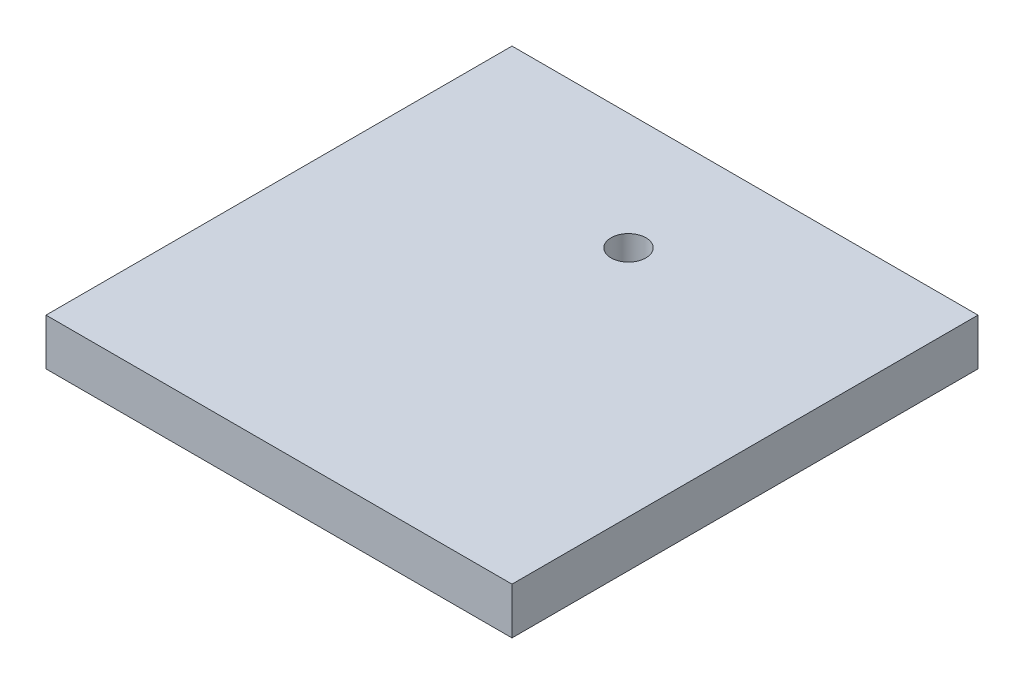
ISO-10303-21;
HEADER;
FILE_DESCRIPTION(('STEP AP214'),'2;1');
FILE_NAME('part.step','',(''),(''),'','','');
FILE_SCHEMA(('AUTOMOTIVE_DESIGN { 1 0 10303 214 1 1 1 1 }'));
ENDSEC;
DATA;
#1=APPLICATION_CONTEXT('core data for automotive mechanical design processes');
#2=APPLICATION_PROTOCOL_DEFINITION('international standard','automotive_design',2000,#1);
#3=PRODUCT_CONTEXT('',#1,'mechanical');
#4=PRODUCT('Part','Part','',(#3));
#5=PRODUCT_RELATED_PRODUCT_CATEGORY('part','',(#4));
#6=PRODUCT_DEFINITION_FORMATION('','',#4);
#7=PRODUCT_DEFINITION_CONTEXT('part definition',#1,'design');
#8=PRODUCT_DEFINITION('design','',#6,#7);
#9=PRODUCT_DEFINITION_SHAPE('','',#8);
#10=(LENGTH_UNIT() NAMED_UNIT(*) SI_UNIT(.MILLI.,.METRE.));
#11=(NAMED_UNIT(*) PLANE_ANGLE_UNIT() SI_UNIT($,.RADIAN.));
#12=(NAMED_UNIT(*) SI_UNIT($,.STERADIAN.) SOLID_ANGLE_UNIT());
#13=UNCERTAINTY_MEASURE_WITH_UNIT(LENGTH_MEASURE(1.E-05),#10,'distance_accuracy_value','');
#14=(GEOMETRIC_REPRESENTATION_CONTEXT(3) GLOBAL_UNCERTAINTY_ASSIGNED_CONTEXT((#13)) GLOBAL_UNIT_ASSIGNED_CONTEXT((#10,
#11,#12)) REPRESENTATION_CONTEXT('',''));
#15=CARTESIAN_POINT('',(0.,0.,0.));
#16=DIRECTION('',(0.,0.,1.));
#17=DIRECTION('',(1.,0.,0.));
#18=AXIS2_PLACEMENT_3D('',#15,#16,#17);
#19=CARTESIAN_POINT('',(0.,10.,0.));
#20=DIRECTION('',(1.,0.,0.));
#21=DIRECTION('',(0.,0.,-1.));
#22=AXIS2_PLACEMENT_3D('',#19,#20,#21);
#23=PLANE('',#22);
#24=DIRECTION('',(0.,0.,1.));
#25=VECTOR('',#24,1.);
#26=CARTESIAN_POINT('',(0.,0.,0.));
#27=LINE('',#26,#25);
#28=CARTESIAN_POINT('',(0.,0.,-100.));
#29=VERTEX_POINT('',#28);
#30=CARTESIAN_POINT('',(0.,0.,0.));
#31=VERTEX_POINT('',#30);
#32=EDGE_CURVE('E97',#29,#31,#27,.T.);
#33=ORIENTED_EDGE('',*,*,#32,.T.);
#34=DIRECTION('',(0.,-1.,0.));
#35=VECTOR('',#34,1.);
#36=CARTESIAN_POINT('',(0.,10.,0.));
#37=LINE('',#36,#35);
#38=CARTESIAN_POINT('',(0.,10.,0.));
#39=VERTEX_POINT('',#38);
#40=EDGE_CURVE('E11',#39,#31,#37,.T.);
#41=ORIENTED_EDGE('',*,*,#40,.F.);
#42=DIRECTION('',(0.,0.,1.));
#43=VECTOR('',#42,1.);
#44=CARTESIAN_POINT('',(0.,10.,0.));
#45=LINE('',#44,#43);
#46=CARTESIAN_POINT('',(0.,10.,-100.));
#47=VERTEX_POINT('',#46);
#48=EDGE_CURVE('E84',#47,#39,#45,.T.);
#49=ORIENTED_EDGE('',*,*,#48,.F.);
#50=DIRECTION('',(0.,-1.,0.));
#51=VECTOR('',#50,1.);
#52=CARTESIAN_POINT('',(0.,10.,-100.));
#53=LINE('',#52,#51);
#54=EDGE_CURVE('E93',#47,#29,#53,.T.);
#55=ORIENTED_EDGE('',*,*,#54,.T.);
#56=EDGE_LOOP('',(#33,#41,#49,#55));
#57=FACE_BOUND('',#56,.T.);
#58=ADVANCED_FACE('F32',(#57),#23,.F.);
#59=CARTESIAN_POINT('',(0.,10.,0.));
#60=DIRECTION('',(0.,0.,-1.));
#61=DIRECTION('',(-1.,0.,0.));
#62=AXIS2_PLACEMENT_3D('',#59,#60,#61);
#63=PLANE('',#62);
#64=DIRECTION('',(1.,0.,0.));
#65=VECTOR('',#64,1.);
#66=CARTESIAN_POINT('',(0.,0.,0.));
#67=LINE('',#66,#65);
#68=CARTESIAN_POINT('',(100.,0.,0.));
#69=VERTEX_POINT('',#68);
#70=EDGE_CURVE('E88',#31,#69,#67,.T.);
#71=ORIENTED_EDGE('',*,*,#70,.T.);
#72=DIRECTION('',(0.,-1.,0.));
#73=VECTOR('',#72,1.);
#74=CARTESIAN_POINT('',(100.,10.,0.));
#75=LINE('',#74,#73);
#76=CARTESIAN_POINT('',(100.,10.,0.));
#77=VERTEX_POINT('',#76);
#78=EDGE_CURVE('E41',#77,#69,#75,.T.);
#79=ORIENTED_EDGE('',*,*,#78,.F.);
#80=DIRECTION('',(1.,0.,0.));
#81=VECTOR('',#80,1.);
#82=CARTESIAN_POINT('',(0.,10.,0.));
#83=LINE('',#82,#81);
#84=EDGE_CURVE('E79',#39,#77,#83,.T.);
#85=ORIENTED_EDGE('',*,*,#84,.F.);
#86=ORIENTED_EDGE('',*,*,#40,.T.);
#87=EDGE_LOOP('',(#71,#79,#85,#86));
#88=FACE_BOUND('',#87,.T.);
#89=ADVANCED_FACE('F87',(#88),#63,.F.);
#90=CARTESIAN_POINT('',(100.,10.,0.));
#91=DIRECTION('',(-1.,0.,0.));
#92=DIRECTION('',(0.,0.,1.));
#93=AXIS2_PLACEMENT_3D('',#90,#91,#92);
#94=PLANE('',#93);
#95=DIRECTION('',(0.,0.,-1.));
#96=VECTOR('',#95,1.);
#97=CARTESIAN_POINT('',(100.,0.,0.));
#98=LINE('',#97,#96);
#99=CARTESIAN_POINT('',(100.,0.,-100.));
#100=VERTEX_POINT('',#99);
#101=EDGE_CURVE('E66',#69,#100,#98,.T.);
#102=ORIENTED_EDGE('',*,*,#101,.T.);
#103=DIRECTION('',(0.,-1.,0.));
#104=VECTOR('',#103,1.);
#105=CARTESIAN_POINT('',(100.,10.,-100.));
#106=LINE('',#105,#104);
#107=CARTESIAN_POINT('',(100.,10.,-100.));
#108=VERTEX_POINT('',#107);
#109=EDGE_CURVE('E89',#108,#100,#106,.T.);
#110=ORIENTED_EDGE('',*,*,#109,.F.);
#111=DIRECTION('',(0.,0.,-1.));
#112=VECTOR('',#111,1.);
#113=CARTESIAN_POINT('',(100.,10.,0.));
#114=LINE('',#113,#112);
#115=EDGE_CURVE('E82',#77,#108,#114,.T.);
#116=ORIENTED_EDGE('',*,*,#115,.F.);
#117=ORIENTED_EDGE('',*,*,#78,.T.);
#118=EDGE_LOOP('',(#102,#110,#116,#117));
#119=FACE_BOUND('',#118,.T.);
#120=ADVANCED_FACE('F91',(#119),#94,.F.);
#121=CARTESIAN_POINT('',(0.,10.,-100.));
#122=DIRECTION('',(0.,0.,1.));
#123=DIRECTION('',(1.,0.,0.));
#124=AXIS2_PLACEMENT_3D('',#121,#122,#123);
#125=PLANE('',#124);
#126=DIRECTION('',(-1.,0.,0.));
#127=VECTOR('',#126,1.);
#128=CARTESIAN_POINT('',(0.,0.,-100.));
#129=LINE('',#128,#127);
#130=EDGE_CURVE('E72',#100,#29,#129,.T.);
#131=ORIENTED_EDGE('',*,*,#130,.T.);
#132=ORIENTED_EDGE('',*,*,#54,.F.);
#133=DIRECTION('',(-1.,0.,0.));
#134=VECTOR('',#133,1.);
#135=CARTESIAN_POINT('',(0.,10.,-100.));
#136=LINE('',#135,#134);
#137=EDGE_CURVE('E49',#108,#47,#136,.T.);
#138=ORIENTED_EDGE('',*,*,#137,.F.);
#139=ORIENTED_EDGE('',*,*,#109,.T.);
#140=EDGE_LOOP('',(#131,#132,#138,#139));
#141=FACE_BOUND('',#140,.T.);
#142=ADVANCED_FACE('F104',(#141),#125,.F.);
#143=CARTESIAN_POINT('',(0.,10.,-100.));
#144=DIRECTION('',(0.,-1.,0.));
#145=DIRECTION('',(0.,0.,-1.));
#146=AXIS2_PLACEMENT_3D('',#143,#144,#145);
#147=PLANE('',#146);
#148=CARTESIAN_POINT('',(50.,10.,-75.));
#149=DIRECTION('',(0.,1.,0.));
#150=DIRECTION('',(0.,0.,1.));
#151=AXIS2_PLACEMENT_3D('',#148,#149,#150);
#152=CIRCLE('',#151,3.75);
#153=CARTESIAN_POINT('',(50.,10.,-71.25));
#154=VERTEX_POINT('',#153);
#155=EDGE_CURVE('E113',#154,#154,#152,.T.);
#156=ORIENTED_EDGE('',*,*,#155,.F.);
#157=EDGE_LOOP('',(#156));
#158=FACE_BOUND('',#157,.T.);
#159=ORIENTED_EDGE('',*,*,#48,.T.);
#160=ORIENTED_EDGE('',*,*,#84,.T.);
#161=ORIENTED_EDGE('',*,*,#115,.T.);
#162=ORIENTED_EDGE('',*,*,#137,.T.);
#163=EDGE_LOOP('',(#159,#160,#161,#162));
#164=FACE_BOUND('',#163,.T.);
#165=ADVANCED_FACE('F80',(#158,#164),#147,.F.);
#166=CARTESIAN_POINT('',(0.,0.,-100.));
#167=DIRECTION('',(0.,-1.,0.));
#168=DIRECTION('',(0.,0.,-1.));
#169=AXIS2_PLACEMENT_3D('',#166,#167,#168);
#170=PLANE('',#169);
#171=CARTESIAN_POINT('',(50.,0.,-75.));
#172=DIRECTION('',(0.,-1.,0.));
#173=DIRECTION('',(0.,0.,-1.));
#174=AXIS2_PLACEMENT_3D('',#171,#172,#173);
#175=CIRCLE('',#174,0.421441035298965);
#176=CARTESIAN_POINT('',(50.,0.,-74.578558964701));
#177=VERTEX_POINT('',#176);
#178=EDGE_CURVE('E35',#177,#177,#175,.T.);
#179=ORIENTED_EDGE('',*,*,#178,.F.);
#180=EDGE_LOOP('',(#179));
#181=FACE_BOUND('',#180,.T.);
#182=ORIENTED_EDGE('',*,*,#32,.F.);
#183=ORIENTED_EDGE('',*,*,#130,.F.);
#184=ORIENTED_EDGE('',*,*,#101,.F.);
#185=ORIENTED_EDGE('',*,*,#70,.F.);
#186=EDGE_LOOP('',(#182,#183,#184,#185));
#187=FACE_BOUND('',#186,.T.);
#188=ADVANCED_FACE('F107',(#181,#187),#170,.T.);
#189=CARTESIAN_POINT('',(50.,2.,-75.));
#190=DIRECTION('',(0.,1.,0.));
#191=DIRECTION('',(0.,0.,1.));
#192=AXIS2_PLACEMENT_3D('',#189,#190,#191);
#193=CONICAL_SURFACE('',#192,3.75,1.02974425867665);
#194=CARTESIAN_POINT('',(50.,2.,-75.));
#195=DIRECTION('',(0.,1.,0.));
#196=DIRECTION('',(0.,0.,1.));
#197=AXIS2_PLACEMENT_3D('',#194,#195,#196);
#198=CIRCLE('',#197,3.75);
#199=CARTESIAN_POINT('',(50.,2.,-71.25));
#200=VERTEX_POINT('',#199);
#201=EDGE_CURVE('E110',#200,#200,#198,.T.);
#202=CARTESIAN_POINT('',(50.,0.,-74.578558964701));
#203=CARTESIAN_POINT('',(50.,0.0208333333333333,-74.5438864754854));
#204=CARTESIAN_POINT('',(50.,0.0416666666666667,-74.5092139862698));
#205=CARTESIAN_POINT('',(50.,0.0833333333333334,-74.4398690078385));
#206=CARTESIAN_POINT('',(50.,0.104166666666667,-74.4051965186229));
#207=CARTESIAN_POINT('',(50.,0.145833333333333,-74.3358515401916));
#208=CARTESIAN_POINT('',(50.,0.166666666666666,-74.301179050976));
#209=CARTESIAN_POINT('',(50.,0.208333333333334,-74.2318340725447));
#210=CARTESIAN_POINT('',(50.,0.229166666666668,-74.1971615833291));
#211=CARTESIAN_POINT('',(50.,0.270833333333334,-74.1278166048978));
#212=CARTESIAN_POINT('',(50.,0.291666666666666,-74.0931441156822));
#213=CARTESIAN_POINT('',(50.,0.333333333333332,-74.0237991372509));
#214=CARTESIAN_POINT('',(50.,0.354166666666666,-73.9891266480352));
#215=CARTESIAN_POINT('',(50.,0.395833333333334,-73.919781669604));
#216=CARTESIAN_POINT('',(50.,0.416666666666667,-73.8851091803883));
#217=CARTESIAN_POINT('',(50.,0.458333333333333,-73.8157642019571));
#218=CARTESIAN_POINT('',(50.,0.479166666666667,-73.7810917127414));
#219=CARTESIAN_POINT('',(50.,0.520833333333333,-73.7117467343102));
#220=CARTESIAN_POINT('',(50.,0.541666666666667,-73.6770742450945));
#221=CARTESIAN_POINT('',(50.,0.583333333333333,-73.6077292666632));
#222=CARTESIAN_POINT('',(50.,0.604166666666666,-73.5730567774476));
#223=CARTESIAN_POINT('',(50.,0.645833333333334,-73.5037117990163));
#224=CARTESIAN_POINT('',(50.,0.666666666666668,-73.4690393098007));
#225=CARTESIAN_POINT('',(50.,0.708333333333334,-73.3996943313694));
#226=CARTESIAN_POINT('',(50.,0.729166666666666,-73.3650218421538));
#227=CARTESIAN_POINT('',(50.,0.770833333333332,-73.2956768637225));
#228=CARTESIAN_POINT('',(50.,0.791666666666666,-73.2610043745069));
#229=CARTESIAN_POINT('',(50.,0.833333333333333,-73.1916593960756));
#230=CARTESIAN_POINT('',(50.,0.854166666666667,-73.15698690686));
#231=CARTESIAN_POINT('',(50.,0.895833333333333,-73.0876419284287));
#232=CARTESIAN_POINT('',(50.,0.916666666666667,-73.0529694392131));
#233=CARTESIAN_POINT('',(50.,0.958333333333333,-72.9836244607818));
#234=CARTESIAN_POINT('',(50.,0.979166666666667,-72.9489519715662));
#235=CARTESIAN_POINT('',(50.,1.02083333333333,-72.8796069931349));
#236=CARTESIAN_POINT('',(50.,1.04166666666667,-72.8449345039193));
#237=CARTESIAN_POINT('',(50.,1.08333333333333,-72.775589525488));
#238=CARTESIAN_POINT('',(50.,1.10416666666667,-72.7409170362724));
#239=CARTESIAN_POINT('',(50.,1.14583333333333,-72.6715720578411));
#240=CARTESIAN_POINT('',(50.,1.16666666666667,-72.6368995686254));
#241=CARTESIAN_POINT('',(50.,1.20833333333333,-72.5675545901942));
#242=CARTESIAN_POINT('',(50.,1.22916666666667,-72.5328821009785));
#243=CARTESIAN_POINT('',(50.,1.27083333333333,-72.4635371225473));
#244=CARTESIAN_POINT('',(50.,1.29166666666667,-72.4288646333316));
#245=CARTESIAN_POINT('',(50.,1.33333333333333,-72.3595196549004));
#246=CARTESIAN_POINT('',(50.,1.35416666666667,-72.3248471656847));
#247=CARTESIAN_POINT('',(50.,1.39583333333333,-72.2555021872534));
#248=CARTESIAN_POINT('',(50.,1.41666666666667,-72.2208296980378));
#249=CARTESIAN_POINT('',(50.,1.45833333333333,-72.1514847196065));
#250=CARTESIAN_POINT('',(50.,1.47916666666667,-72.1168122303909));
#251=CARTESIAN_POINT('',(50.,1.52083333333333,-72.0474672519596));
#252=CARTESIAN_POINT('',(50.,1.54166666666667,-72.012794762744));
#253=CARTESIAN_POINT('',(50.,1.58333333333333,-71.9434497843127));
#254=CARTESIAN_POINT('',(50.,1.60416666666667,-71.9087772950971));
#255=CARTESIAN_POINT('',(50.,1.64583333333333,-71.8394323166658));
#256=CARTESIAN_POINT('',(50.,1.66666666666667,-71.8047598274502));
#257=CARTESIAN_POINT('',(50.,1.70833333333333,-71.7354148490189));
#258=CARTESIAN_POINT('',(50.,1.72916666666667,-71.7007423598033));
#259=CARTESIAN_POINT('',(50.,1.77083333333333,-71.631397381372));
#260=CARTESIAN_POINT('',(50.,1.79166666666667,-71.5967248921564));
#261=CARTESIAN_POINT('',(50.,1.83333333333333,-71.5273799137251));
#262=CARTESIAN_POINT('',(50.,1.85416666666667,-71.4927074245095));
#263=CARTESIAN_POINT('',(50.,1.89583333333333,-71.4233624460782));
#264=CARTESIAN_POINT('',(50.,1.91666666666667,-71.3886899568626));
#265=CARTESIAN_POINT('',(50.,1.95833333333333,-71.3193449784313));
#266=CARTESIAN_POINT('',(50.,1.97916666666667,-71.2846724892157));
#267=CARTESIAN_POINT('',(50.,2.,-71.25));
#268=B_SPLINE_CURVE_WITH_KNOTS('',3,(#202,#203,#204,#205,#206,#207,#208,#209,#210,#211,#212,
#213,#214,#215,#216,#217,#218,#219,#220,#221,#222,#223,#224,#225,#226,#227,#228,#229,#230,#231,
#232,#233,#234,#235,#236,#237,#238,#239,#240,#241,#242,#243,#244,#245,#246,#247,#248,#249,#250,
#251,#252,#253,#254,#255,#256,#257,#258,#259,#260,#261,#262,#263,#264,#265,#266,#267),
.UNSPECIFIED.,.F.,.F.,(4,2,2,2,2,2,2,2,2,2,2,2,2,2,2,2,2,2,2,2,2,2,2,2,2,2,2,2,2,2,2,2,4),(0.,
0.121350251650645,0.242700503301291,0.364050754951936,0.485401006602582,0.606751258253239,
0.728101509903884,0.84945176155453,0.970802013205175,1.09215226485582,1.21350251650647,
1.33485276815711,1.45620301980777,1.57755327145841,1.69890352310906,1.82025377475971,
1.94160402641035,2.062954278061,2.18430452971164,2.3056547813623,2.42700503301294,
2.54835528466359,2.66970553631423,2.79105578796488,2.91240603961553,3.03375629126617,
3.15510654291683,3.27645679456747,3.39780704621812,3.51915729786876,3.64050754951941,
3.76185780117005,3.8832080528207),.UNSPECIFIED.);
#269=EDGE_CURVE('BSEAM125',#177,#200,#268,.T.);
#270=ORIENTED_EDGE('',*,*,#178,.T.);
#271=ORIENTED_EDGE('',*,*,#201,.T.);
#272=ORIENTED_EDGE('',*,*,#269,.T.);
#273=ORIENTED_EDGE('',*,*,#269,.F.);
#274=EDGE_LOOP('',(#270,#272,#271,#273));
#275=FACE_BOUND('',#274,.T.);
#276=ADVANCED_FACE('F125',(#275),#193,.F.);
#277=CARTESIAN_POINT('',(50.,10.,-75.));
#278=DIRECTION('',(0.,1.,0.));
#279=DIRECTION('',(0.,0.,1.));
#280=AXIS2_PLACEMENT_3D('',#277,#278,#279);
#281=CYLINDRICAL_SURFACE('',#280,3.75);
#282=ORIENTED_EDGE('',*,*,#201,.F.);
#283=EDGE_LOOP('',(#282));
#284=FACE_BOUND('',#283,.T.);
#285=ORIENTED_EDGE('',*,*,#155,.T.);
#286=EDGE_LOOP('',(#285));
#287=FACE_BOUND('',#286,.T.);
#288=ADVANCED_FACE('F117',(#284,#287),#281,.F.);
#289=CLOSED_SHELL('',(#58,#89,#120,#142,#165,#188,#276,#288));
#290=MANIFOLD_SOLID_BREP('B2',#289);
#291=ADVANCED_BREP_SHAPE_REPRESENTATION('',(#18,#290),#14);
#292=SHAPE_DEFINITION_REPRESENTATION(#9,#291);
ENDSEC;
END-ISO-10303-21;
